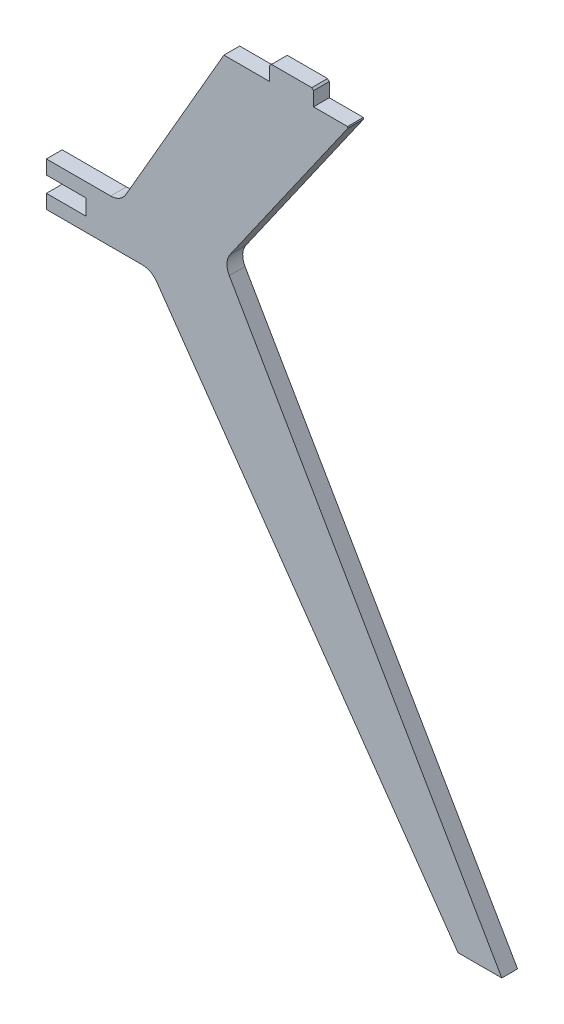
ISO-10303-21;
HEADER;
FILE_DESCRIPTION(('STEP AP214'),'2;1');
FILE_NAME('part.step','',(''),(''),'','','');
FILE_SCHEMA(('AUTOMOTIVE_DESIGN { 1 0 10303 214 1 1 1 1 }'));
ENDSEC;
DATA;
#1=APPLICATION_CONTEXT('core data for automotive mechanical design processes');
#2=APPLICATION_PROTOCOL_DEFINITION('international standard','automotive_design',2000,#1);
#3=PRODUCT_CONTEXT('',#1,'mechanical');
#4=PRODUCT('Part','Part','',(#3));
#5=PRODUCT_RELATED_PRODUCT_CATEGORY('part','',(#4));
#6=PRODUCT_DEFINITION_FORMATION('','',#4);
#7=PRODUCT_DEFINITION_CONTEXT('part definition',#1,'design');
#8=PRODUCT_DEFINITION('design','',#6,#7);
#9=PRODUCT_DEFINITION_SHAPE('','',#8);
#10=(LENGTH_UNIT() NAMED_UNIT(*) SI_UNIT(.MILLI.,.METRE.));
#11=(NAMED_UNIT(*) PLANE_ANGLE_UNIT() SI_UNIT($,.RADIAN.));
#12=(NAMED_UNIT(*) SI_UNIT($,.STERADIAN.) SOLID_ANGLE_UNIT());
#13=UNCERTAINTY_MEASURE_WITH_UNIT(LENGTH_MEASURE(1.E-05),#10,'distance_accuracy_value','');
#14=(GEOMETRIC_REPRESENTATION_CONTEXT(3) GLOBAL_UNCERTAINTY_ASSIGNED_CONTEXT((#13)) GLOBAL_UNIT_ASSIGNED_CONTEXT((#10,
#11,#12)) REPRESENTATION_CONTEXT('',''));
#15=CARTESIAN_POINT('',(0.,0.,0.));
#16=DIRECTION('',(0.,0.,1.));
#17=DIRECTION('',(1.,0.,0.));
#18=AXIS2_PLACEMENT_3D('',#15,#16,#17);
#19=CARTESIAN_POINT('',(-317.334691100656,754.,18.));
#20=DIRECTION('',(0.,-1.,0.));
#21=DIRECTION('',(0.,0.,-1.));
#22=AXIS2_PLACEMENT_3D('',#19,#20,#21);
#23=PLANE('',#22);
#24=DIRECTION('',(0.,0.,1.));
#25=VECTOR('',#24,1.);
#26=CARTESIAN_POINT('',(-264.999999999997,754.,0.));
#27=LINE('',#26,#25);
#28=CARTESIAN_POINT('',(-264.999999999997,754.,0.));
#29=VERTEX_POINT('',#28);
#30=CARTESIAN_POINT('',(-264.999999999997,754.,18.));
#31=VERTEX_POINT('',#30);
#32=EDGE_CURVE('E217',#29,#31,#27,.T.);
#33=ORIENTED_EDGE('',*,*,#32,.F.);
#34=DIRECTION('',(-1.,0.,0.));
#35=VECTOR('',#34,1.);
#36=CARTESIAN_POINT('',(-317.334691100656,754.,0.));
#37=LINE('',#36,#35);
#38=CARTESIAN_POINT('',(-317.334691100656,754.,0.));
#39=VERTEX_POINT('',#38);
#40=EDGE_CURVE('E211',#29,#39,#37,.T.);
#41=ORIENTED_EDGE('',*,*,#40,.T.);
#42=DIRECTION('',(0.,0.,-1.));
#43=VECTOR('',#42,1.);
#44=CARTESIAN_POINT('',(-317.334691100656,754.,18.));
#45=LINE('',#44,#43);
#46=CARTESIAN_POINT('',(-317.334691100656,754.,18.));
#47=VERTEX_POINT('',#46);
#48=EDGE_CURVE('E307',#47,#39,#45,.T.);
#49=ORIENTED_EDGE('',*,*,#48,.F.);
#50=DIRECTION('',(-1.,0.,0.));
#51=VECTOR('',#50,1.);
#52=CARTESIAN_POINT('',(-317.334691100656,754.,18.));
#53=LINE('',#52,#51);
#54=EDGE_CURVE('E240',#31,#47,#53,.T.);
#55=ORIENTED_EDGE('',*,*,#54,.F.);
#56=EDGE_LOOP('',(#33,#41,#49,#55));
#57=FACE_BOUND('',#56,.T.);
#58=ADVANCED_FACE('F35',(#57),#23,.F.);
#59=CARTESIAN_POINT('',(-176.136340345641,754.,18.));
#60=VERTEX_POINT('',#59);
#61=CARTESIAN_POINT('',(-214.999999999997,754.,18.));
#62=VERTEX_POINT('',#61);
#63=EDGE_CURVE('E241',#60,#62,#53,.T.);
#64=ORIENTED_EDGE('',*,*,#63,.F.);
#65=DIRECTION('',(0.,0.,-1.));
#66=VECTOR('',#65,1.);
#67=CARTESIAN_POINT('',(-176.136340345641,754.,18.));
#68=LINE('',#67,#66);
#69=CARTESIAN_POINT('',(-176.136340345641,754.,0.));
#70=VERTEX_POINT('',#69);
#71=EDGE_CURVE('E209',#60,#70,#68,.T.);
#72=ORIENTED_EDGE('',*,*,#71,.T.);
#73=CARTESIAN_POINT('',(-214.999999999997,754.,0.));
#74=VERTEX_POINT('',#73);
#75=EDGE_CURVE('E193',#70,#74,#37,.T.);
#76=ORIENTED_EDGE('',*,*,#75,.T.);
#77=DIRECTION('',(0.,0.,-1.));
#78=VECTOR('',#77,1.);
#79=CARTESIAN_POINT('',(-214.999999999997,754.,18.));
#80=LINE('',#79,#78);
#81=EDGE_CURVE('E207',#62,#74,#80,.T.);
#82=ORIENTED_EDGE('',*,*,#81,.F.);
#83=EDGE_LOOP('',(#64,#72,#76,#82));
#84=FACE_BOUND('',#83,.T.);
#85=ADVANCED_FACE('F206',(#84),#23,.F.);
#86=CARTESIAN_POINT('',(-50.,0.,18.));
#87=DIRECTION('',(0.,1.,0.));
#88=DIRECTION('',(0.,0.,1.));
#89=AXIS2_PLACEMENT_3D('',#86,#87,#88);
#90=PLANE('',#89);
#91=DIRECTION('',(1.,0.,0.));
#92=VECTOR('',#91,1.);
#93=CARTESIAN_POINT('',(-50.,0.,0.));
#94=LINE('',#93,#92);
#95=CARTESIAN_POINT('',(-50.,0.,0.));
#96=VERTEX_POINT('',#95);
#97=CARTESIAN_POINT('',(0.,0.,0.));
#98=VERTEX_POINT('',#97);
#99=EDGE_CURVE('E230',#96,#98,#94,.T.);
#100=ORIENTED_EDGE('',*,*,#99,.T.);
#101=DIRECTION('',(0.,0.,-1.));
#102=VECTOR('',#101,1.);
#103=CARTESIAN_POINT('',(0.,0.,18.));
#104=LINE('',#103,#102);
#105=CARTESIAN_POINT('',(0.,0.,18.));
#106=VERTEX_POINT('',#105);
#107=EDGE_CURVE('E310',#106,#98,#104,.T.);
#108=ORIENTED_EDGE('',*,*,#107,.F.);
#109=DIRECTION('',(1.,0.,0.));
#110=VECTOR('',#109,1.);
#111=CARTESIAN_POINT('',(-50.,0.,18.));
#112=LINE('',#111,#110);
#113=CARTESIAN_POINT('',(-50.,0.,18.));
#114=VERTEX_POINT('',#113);
#115=EDGE_CURVE('E231',#114,#106,#112,.T.);
#116=ORIENTED_EDGE('',*,*,#115,.F.);
#117=DIRECTION('',(0.,0.,-1.));
#118=VECTOR('',#117,1.);
#119=CARTESIAN_POINT('',(-50.,0.,18.));
#120=LINE('',#119,#118);
#121=EDGE_CURVE('E262',#114,#96,#120,.T.);
#122=ORIENTED_EDGE('',*,*,#121,.T.);
#123=EDGE_LOOP('',(#100,#108,#116,#122));
#124=FACE_BOUND('',#123,.T.);
#125=ADVANCED_FACE('F449',(#124),#90,.F.);
#126=CARTESIAN_POINT('',(0.,0.,18.));
#127=DIRECTION('',(-0.866025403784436,-0.500000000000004,0.));
#128=DIRECTION('',(0.500000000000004,-0.866025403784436,0.));
#129=AXIS2_PLACEMENT_3D('',#126,#127,#128);
#130=PLANE('',#129);
#131=DIRECTION('',(-0.500000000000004,0.866025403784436,0.));
#132=VECTOR('',#131,1.);
#133=CARTESIAN_POINT('',(0.,0.,0.));
#134=LINE('',#133,#132);
#135=CARTESIAN_POINT('',(-311.171945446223,538.965619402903,0.));
#136=VERTEX_POINT('',#135);
#137=EDGE_CURVE('E265',#98,#136,#134,.T.);
#138=ORIENTED_EDGE('',*,*,#137,.T.);
#139=DIRECTION('',(0.,0.,-1.));
#140=VECTOR('',#139,1.);
#141=CARTESIAN_POINT('',(-311.171945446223,538.965619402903,18.));
#142=LINE('',#141,#140);
#143=CARTESIAN_POINT('',(-311.171945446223,538.965619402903,18.));
#144=VERTEX_POINT('',#143);
#145=EDGE_CURVE('E341',#136,#144,#142,.F.);
#146=ORIENTED_EDGE('',*,*,#145,.T.);
#147=DIRECTION('',(-0.500000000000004,0.866025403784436,0.));
#148=VECTOR('',#147,1.);
#149=CARTESIAN_POINT('',(0.,0.,18.));
#150=LINE('',#149,#148);
#151=EDGE_CURVE('E234',#106,#144,#150,.T.);
#152=ORIENTED_EDGE('',*,*,#151,.F.);
#153=ORIENTED_EDGE('',*,*,#107,.T.);
#154=EDGE_LOOP('',(#138,#146,#152,#153));
#155=FACE_BOUND('',#154,.T.);
#156=ADVANCED_FACE('F446',(#155),#130,.F.);
#157=CARTESIAN_POINT('',(-317.542648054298,550.,18.));
#158=DIRECTION('',(-0.819152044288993,0.573576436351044,0.));
#159=DIRECTION('',(-0.573576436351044,-0.819152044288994,0.));
#160=AXIS2_PLACEMENT_3D('',#157,#158,#159);
#161=PLANE('',#160);
#162=DIRECTION('',(0.573576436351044,0.819152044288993,0.));
#163=VECTOR('',#162,1.);
#164=CARTESIAN_POINT('',(-317.542648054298,550.,18.));
#165=LINE('',#164,#163);
#166=CARTESIAN_POINT('',(-310.234478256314,560.437148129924,18.));
#167=VERTEX_POINT('',#166);
#168=CARTESIAN_POINT('',(-175.84746313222,752.361695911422,18.));
#169=VERTEX_POINT('',#168);
#170=EDGE_CURVE('E238',#167,#169,#165,.T.);
#171=ORIENTED_EDGE('',*,*,#170,.F.);
#172=DIRECTION('',(0.,0.,-1.));
#173=VECTOR('',#172,1.);
#174=CARTESIAN_POINT('',(-310.234478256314,560.437148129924,0.));
#175=LINE('',#174,#173);
#176=CARTESIAN_POINT('',(-310.234478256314,560.437148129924,0.));
#177=VERTEX_POINT('',#176);
#178=EDGE_CURVE('E338',#167,#177,#175,.T.);
#179=ORIENTED_EDGE('',*,*,#178,.T.);
#180=DIRECTION('',(0.573576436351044,0.819152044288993,0.));
#181=VECTOR('',#180,1.);
#182=CARTESIAN_POINT('',(-317.542648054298,550.,0.));
#183=LINE('',#182,#181);
#184=CARTESIAN_POINT('',(-175.84746313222,752.361695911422,0.));
#185=VERTEX_POINT('',#184);
#186=EDGE_CURVE('E268',#177,#185,#183,.T.);
#187=ORIENTED_EDGE('',*,*,#186,.T.);
#188=DIRECTION('',(0.,0.,1.));
#189=VECTOR('',#188,1.);
#190=CARTESIAN_POINT('',(-175.84746313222,752.361695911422,18.));
#191=LINE('',#190,#189);
#192=EDGE_CURVE('E319',#185,#169,#191,.T.);
#193=ORIENTED_EDGE('',*,*,#192,.T.);
#194=EDGE_LOOP('',(#171,#179,#187,#193));
#195=FACE_BOUND('',#194,.T.);
#196=ADVANCED_FACE('F439',(#195),#161,.F.);
#197=CARTESIAN_POINT('',(-435.114146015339,550.,18.));
#198=DIRECTION('',(0.86602540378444,-0.499999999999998,0.));
#199=DIRECTION('',(0.499999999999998,0.86602540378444,0.));
#200=AXIS2_PLACEMENT_3D('',#197,#198,#199);
#201=PLANE('',#200);
#202=DIRECTION('',(-0.499999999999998,-0.86602540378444,0.));
#203=VECTOR('',#202,1.);
#204=CARTESIAN_POINT('',(-435.114146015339,550.,0.));
#205=LINE('',#204,#203);
#206=CARTESIAN_POINT('',(-429.340643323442,560.,0.));
#207=VERTEX_POINT('',#206);
#208=EDGE_CURVE('E210',#39,#207,#205,.T.);
#209=ORIENTED_EDGE('',*,*,#208,.T.);
#210=DIRECTION('',(0.,0.,-1.));
#211=VECTOR('',#210,1.);
#212=CARTESIAN_POINT('',(-429.340643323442,560.,18.));
#213=LINE('',#212,#211);
#214=CARTESIAN_POINT('',(-429.340643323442,560.,18.));
#215=VERTEX_POINT('',#214);
#216=EDGE_CURVE('E50',#207,#215,#213,.F.);
#217=ORIENTED_EDGE('',*,*,#216,.T.);
#218=DIRECTION('',(-0.499999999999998,-0.86602540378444,0.));
#219=VECTOR('',#218,1.);
#220=CARTESIAN_POINT('',(-435.114146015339,550.,18.));
#221=LINE('',#220,#219);
#222=EDGE_CURVE('E243',#47,#215,#221,.T.);
#223=ORIENTED_EDGE('',*,*,#222,.F.);
#224=ORIENTED_EDGE('',*,*,#48,.T.);
#225=EDGE_LOOP('',(#209,#217,#223,#224));
#226=FACE_BOUND('',#225,.T.);
#227=ADVANCED_FACE('F411',(#226),#201,.F.);
#228=CARTESIAN_POINT('',(-520.,550.,18.));
#229=DIRECTION('',(0.,-1.,0.));
#230=DIRECTION('',(0.,0.,-1.));
#231=AXIS2_PLACEMENT_3D('',#228,#229,#230);
#232=PLANE('',#231);
#233=DIRECTION('',(-1.,0.,0.));
#234=VECTOR('',#233,1.);
#235=CARTESIAN_POINT('',(-520.,550.,18.));
#236=LINE('',#235,#234);
#237=CARTESIAN_POINT('',(-446.661151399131,550.,18.));
#238=VERTEX_POINT('',#237);
#239=CARTESIAN_POINT('',(-520.,550.,18.));
#240=VERTEX_POINT('',#239);
#241=EDGE_CURVE('E245',#238,#240,#236,.T.);
#242=ORIENTED_EDGE('',*,*,#241,.F.);
#243=DIRECTION('',(0.,0.,-1.));
#244=VECTOR('',#243,1.);
#245=CARTESIAN_POINT('',(-446.661151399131,550.,0.));
#246=LINE('',#245,#244);
#247=CARTESIAN_POINT('',(-446.661151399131,550.,0.));
#248=VERTEX_POINT('',#247);
#249=EDGE_CURVE('E348',#238,#248,#246,.T.);
#250=ORIENTED_EDGE('',*,*,#249,.T.);
#251=DIRECTION('',(-1.,0.,0.));
#252=VECTOR('',#251,1.);
#253=CARTESIAN_POINT('',(-520.,550.,0.));
#254=LINE('',#253,#252);
#255=CARTESIAN_POINT('',(-520.,550.,0.));
#256=VERTEX_POINT('',#255);
#257=EDGE_CURVE('E271',#248,#256,#254,.T.);
#258=ORIENTED_EDGE('',*,*,#257,.T.);
#259=DIRECTION('',(0.,0.,-1.));
#260=VECTOR('',#259,1.);
#261=CARTESIAN_POINT('',(-520.,550.,18.));
#262=LINE('',#261,#260);
#263=EDGE_CURVE('E304',#240,#256,#262,.T.);
#264=ORIENTED_EDGE('',*,*,#263,.F.);
#265=EDGE_LOOP('',(#242,#250,#258,#264));
#266=FACE_BOUND('',#265,.T.);
#267=ADVANCED_FACE('F405',(#266),#232,.F.);
#268=CARTESIAN_POINT('',(-520.,550.,18.));
#269=DIRECTION('',(1.,0.,0.));
#270=DIRECTION('',(0.,1.,0.));
#271=AXIS2_PLACEMENT_3D('',#268,#269,#270);
#272=PLANE('',#271);
#273=DIRECTION('',(0.,-1.,0.));
#274=VECTOR('',#273,1.);
#275=CARTESIAN_POINT('',(-520.,550.,0.));
#276=LINE('',#275,#274);
#277=CARTESIAN_POINT('',(-520.,534.,0.));
#278=VERTEX_POINT('',#277);
#279=EDGE_CURVE('E273',#256,#278,#276,.T.);
#280=ORIENTED_EDGE('',*,*,#279,.T.);
#281=DIRECTION('',(0.,0.,-1.));
#282=VECTOR('',#281,1.);
#283=CARTESIAN_POINT('',(-520.,534.,18.));
#284=LINE('',#283,#282);
#285=CARTESIAN_POINT('',(-520.,534.,18.));
#286=VERTEX_POINT('',#285);
#287=EDGE_CURVE('E301',#286,#278,#284,.T.);
#288=ORIENTED_EDGE('',*,*,#287,.F.);
#289=DIRECTION('',(0.,-1.,0.));
#290=VECTOR('',#289,1.);
#291=CARTESIAN_POINT('',(-520.,550.,18.));
#292=LINE('',#291,#290);
#293=EDGE_CURVE('E247',#240,#286,#292,.T.);
#294=ORIENTED_EDGE('',*,*,#293,.F.);
#295=ORIENTED_EDGE('',*,*,#263,.T.);
#296=EDGE_LOOP('',(#280,#288,#294,#295));
#297=FACE_BOUND('',#296,.T.);
#298=ADVANCED_FACE('F400',(#297),#272,.F.);
#299=CARTESIAN_POINT('',(-520.,534.,18.));
#300=DIRECTION('',(0.,1.,0.));
#301=DIRECTION('',(-1.,0.,0.));
#302=AXIS2_PLACEMENT_3D('',#299,#300,#301);
#303=PLANE('',#302);
#304=DIRECTION('',(1.,0.,0.));
#305=VECTOR('',#304,1.);
#306=CARTESIAN_POINT('',(-520.,534.,0.));
#307=LINE('',#306,#305);
#308=CARTESIAN_POINT('',(-475.,534.,0.));
#309=VERTEX_POINT('',#308);
#310=EDGE_CURVE('E275',#278,#309,#307,.T.);
#311=ORIENTED_EDGE('',*,*,#310,.T.);
#312=DIRECTION('',(0.,0.,-1.));
#313=VECTOR('',#312,1.);
#314=CARTESIAN_POINT('',(-475.,534.,18.));
#315=LINE('',#314,#313);
#316=CARTESIAN_POINT('',(-475.,534.,18.));
#317=VERTEX_POINT('',#316);
#318=EDGE_CURVE('E298',#317,#309,#315,.T.);
#319=ORIENTED_EDGE('',*,*,#318,.F.);
#320=DIRECTION('',(1.,0.,0.));
#321=VECTOR('',#320,1.);
#322=CARTESIAN_POINT('',(-520.,534.,18.));
#323=LINE('',#322,#321);
#324=EDGE_CURVE('E249',#286,#317,#323,.T.);
#325=ORIENTED_EDGE('',*,*,#324,.F.);
#326=ORIENTED_EDGE('',*,*,#287,.T.);
#327=EDGE_LOOP('',(#311,#319,#325,#326));
#328=FACE_BOUND('',#327,.T.);
#329=ADVANCED_FACE('F396',(#328),#303,.F.);
#330=CARTESIAN_POINT('',(-475.,534.,18.));
#331=DIRECTION('',(1.,0.,0.));
#332=DIRECTION('',(0.,1.,0.));
#333=AXIS2_PLACEMENT_3D('',#330,#331,#332);
#334=PLANE('',#333);
#335=DIRECTION('',(0.,-1.,0.));
#336=VECTOR('',#335,1.);
#337=CARTESIAN_POINT('',(-475.,534.,0.));
#338=LINE('',#337,#336);
#339=CARTESIAN_POINT('',(-475.,516.,0.));
#340=VERTEX_POINT('',#339);
#341=EDGE_CURVE('E277',#309,#340,#338,.T.);
#342=ORIENTED_EDGE('',*,*,#341,.T.);
#343=DIRECTION('',(0.,0.,-1.));
#344=VECTOR('',#343,1.);
#345=CARTESIAN_POINT('',(-475.,516.,18.));
#346=LINE('',#345,#344);
#347=CARTESIAN_POINT('',(-475.,516.,18.));
#348=VERTEX_POINT('',#347);
#349=EDGE_CURVE('E295',#348,#340,#346,.T.);
#350=ORIENTED_EDGE('',*,*,#349,.F.);
#351=DIRECTION('',(0.,-1.,0.));
#352=VECTOR('',#351,1.);
#353=CARTESIAN_POINT('',(-475.,534.,18.));
#354=LINE('',#353,#352);
#355=EDGE_CURVE('E251',#317,#348,#354,.T.);
#356=ORIENTED_EDGE('',*,*,#355,.F.);
#357=ORIENTED_EDGE('',*,*,#318,.T.);
#358=EDGE_LOOP('',(#342,#350,#356,#357));
#359=FACE_BOUND('',#358,.T.);
#360=ADVANCED_FACE('F392',(#359),#334,.F.);
#361=CARTESIAN_POINT('',(-475.,516.,18.));
#362=DIRECTION('',(0.,-1.,0.));
#363=DIRECTION('',(0.,0.,-1.));
#364=AXIS2_PLACEMENT_3D('',#361,#362,#363);
#365=PLANE('',#364);
#366=DIRECTION('',(-1.,0.,0.));
#367=VECTOR('',#366,1.);
#368=CARTESIAN_POINT('',(-475.,516.,0.));
#369=LINE('',#368,#367);
#370=CARTESIAN_POINT('',(-520.,516.,0.));
#371=VERTEX_POINT('',#370);
#372=EDGE_CURVE('E279',#340,#371,#369,.T.);
#373=ORIENTED_EDGE('',*,*,#372,.T.);
#374=DIRECTION('',(0.,0.,-1.));
#375=VECTOR('',#374,1.);
#376=CARTESIAN_POINT('',(-520.,516.,18.));
#377=LINE('',#376,#375);
#378=CARTESIAN_POINT('',(-520.,516.,18.));
#379=VERTEX_POINT('',#378);
#380=EDGE_CURVE('E292',#379,#371,#377,.T.);
#381=ORIENTED_EDGE('',*,*,#380,.F.);
#382=DIRECTION('',(-1.,0.,0.));
#383=VECTOR('',#382,1.);
#384=CARTESIAN_POINT('',(-475.,516.,18.));
#385=LINE('',#384,#383);
#386=EDGE_CURVE('E253',#348,#379,#385,.T.);
#387=ORIENTED_EDGE('',*,*,#386,.F.);
#388=ORIENTED_EDGE('',*,*,#349,.T.);
#389=EDGE_LOOP('',(#373,#381,#387,#388));
#390=FACE_BOUND('',#389,.T.);
#391=ADVANCED_FACE('F387',(#390),#365,.F.);
#392=CARTESIAN_POINT('',(-520.,516.,18.));
#393=DIRECTION('',(1.,0.,0.));
#394=DIRECTION('',(0.,1.,0.));
#395=AXIS2_PLACEMENT_3D('',#392,#393,#394);
#396=PLANE('',#395);
#397=DIRECTION('',(0.,-1.,0.));
#398=VECTOR('',#397,1.);
#399=CARTESIAN_POINT('',(-520.,516.,0.));
#400=LINE('',#399,#398);
#401=CARTESIAN_POINT('',(-520.,500.,0.));
#402=VERTEX_POINT('',#401);
#403=EDGE_CURVE('E281',#371,#402,#400,.T.);
#404=ORIENTED_EDGE('',*,*,#403,.T.);
#405=DIRECTION('',(0.,0.,-1.));
#406=VECTOR('',#405,1.);
#407=CARTESIAN_POINT('',(-520.,500.,18.));
#408=LINE('',#407,#406);
#409=CARTESIAN_POINT('',(-520.,500.,18.));
#410=VERTEX_POINT('',#409);
#411=EDGE_CURVE('E289',#410,#402,#408,.T.);
#412=ORIENTED_EDGE('',*,*,#411,.F.);
#413=DIRECTION('',(0.,-1.,0.));
#414=VECTOR('',#413,1.);
#415=CARTESIAN_POINT('',(-520.,516.,18.));
#416=LINE('',#415,#414);
#417=EDGE_CURVE('E255',#379,#410,#416,.T.);
#418=ORIENTED_EDGE('',*,*,#417,.F.);
#419=ORIENTED_EDGE('',*,*,#380,.T.);
#420=EDGE_LOOP('',(#404,#412,#418,#419));
#421=FACE_BOUND('',#420,.T.);
#422=ADVANCED_FACE('F381',(#421),#396,.F.);
#423=CARTESIAN_POINT('',(-400.103769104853,500.,18.));
#424=DIRECTION('',(0.,1.,0.));
#425=DIRECTION('',(0.,0.,1.));
#426=AXIS2_PLACEMENT_3D('',#423,#424,#425);
#427=PLANE('',#426);
#428=DIRECTION('',(1.,0.,0.));
#429=VECTOR('',#428,1.);
#430=CARTESIAN_POINT('',(-400.103769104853,500.,0.));
#431=LINE('',#430,#429);
#432=CARTESIAN_POINT('',(-410.515110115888,500.,0.));
#433=VERTEX_POINT('',#432);
#434=EDGE_CURVE('E283',#402,#433,#431,.T.);
#435=ORIENTED_EDGE('',*,*,#434,.T.);
#436=DIRECTION('',(0.,0.,-1.));
#437=VECTOR('',#436,1.);
#438=CARTESIAN_POINT('',(-410.515110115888,500.,18.));
#439=LINE('',#438,#437);
#440=CARTESIAN_POINT('',(-410.515110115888,500.,18.));
#441=VERTEX_POINT('',#440);
#442=EDGE_CURVE('E346',#433,#441,#439,.F.);
#443=ORIENTED_EDGE('',*,*,#442,.T.);
#444=DIRECTION('',(1.,0.,0.));
#445=VECTOR('',#444,1.);
#446=CARTESIAN_POINT('',(-400.103769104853,500.,18.));
#447=LINE('',#446,#445);
#448=EDGE_CURVE('E257',#410,#441,#447,.T.);
#449=ORIENTED_EDGE('',*,*,#448,.F.);
#450=ORIENTED_EDGE('',*,*,#411,.T.);
#451=EDGE_LOOP('',(#435,#443,#449,#450));
#452=FACE_BOUND('',#451,.T.);
#453=ADVANCED_FACE('F377',(#452),#427,.F.);
#454=CARTESIAN_POINT('',(-400.103769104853,500.,18.));
#455=DIRECTION('',(0.819152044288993,0.573576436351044,0.));
#456=DIRECTION('',(-0.573576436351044,0.819152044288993,0.));
#457=AXIS2_PLACEMENT_3D('',#454,#455,#456);
#458=PLANE('',#457);
#459=DIRECTION('',(0.573576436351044,-0.819152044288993,0.));
#460=VECTOR('',#459,1.);
#461=CARTESIAN_POINT('',(-400.103769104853,500.,18.));
#462=LINE('',#461,#460);
#463=CARTESIAN_POINT('',(-394.132069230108,491.471528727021,18.));
#464=VERTEX_POINT('',#463);
#465=EDGE_CURVE('E260',#464,#114,#462,.T.);
#466=ORIENTED_EDGE('',*,*,#465,.F.);
#467=DIRECTION('',(0.,0.,-1.));
#468=VECTOR('',#467,1.);
#469=CARTESIAN_POINT('',(-394.132069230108,491.471528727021,0.));
#470=LINE('',#469,#468);
#471=CARTESIAN_POINT('',(-394.132069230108,491.471528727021,0.));
#472=VERTEX_POINT('',#471);
#473=EDGE_CURVE('E343',#464,#472,#470,.T.);
#474=ORIENTED_EDGE('',*,*,#473,.T.);
#475=DIRECTION('',(0.573576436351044,-0.819152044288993,0.));
#476=VECTOR('',#475,1.);
#477=CARTESIAN_POINT('',(-400.103769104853,500.,0.));
#478=LINE('',#477,#476);
#479=EDGE_CURVE('E235',#472,#96,#478,.T.);
#480=ORIENTED_EDGE('',*,*,#479,.T.);
#481=ORIENTED_EDGE('',*,*,#121,.F.);
#482=EDGE_LOOP('',(#466,#474,#480,#481));
#483=FACE_BOUND('',#482,.T.);
#484=ADVANCED_FACE('F369',(#483),#458,.F.);
#485=CARTESIAN_POINT('',(0.,0.,18.));
#486=DIRECTION('',(0.,0.,-1.));
#487=DIRECTION('',(-1.,0.,0.));
#488=AXIS2_PLACEMENT_3D('',#485,#486,#487);
#489=PLANE('',#488);
#490=ORIENTED_EDGE('',*,*,#151,.T.);
#491=CARTESIAN_POINT('',(-293.851437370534,548.965619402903,18.));
#492=DIRECTION('',(0.,0.,-1.));
#493=DIRECTION('',(-1.,0.,0.));
#494=AXIS2_PLACEMENT_3D('',#491,#492,#493);
#495=CIRCLE('',#494,20.);
#496=EDGE_CURVE('E354',#144,#167,#495,.T.);
#497=ORIENTED_EDGE('',*,*,#496,.T.);
#498=ORIENTED_EDGE('',*,*,#170,.T.);
#499=DIRECTION('',(0.17364817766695,-0.984807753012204,0.));
#500=VECTOR('',#499,1.);
#501=CARTESIAN_POINT('',(-176.136340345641,754.,18.));
#502=LINE('',#501,#500);
#503=EDGE_CURVE('E326',#169,#60,#502,.F.);
#504=ORIENTED_EDGE('',*,*,#503,.T.);
#505=ORIENTED_EDGE('',*,*,#63,.T.);
#506=DIRECTION('',(0.,-1.,0.));
#507=VECTOR('',#506,1.);
#508=CARTESIAN_POINT('',(-214.999999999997,772.,18.));
#509=LINE('',#508,#507);
#510=CARTESIAN_POINT('',(-214.999999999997,770.,18.));
#511=VERTEX_POINT('',#510);
#512=EDGE_CURVE('E199',#511,#62,#509,.T.);
#513=ORIENTED_EDGE('',*,*,#512,.F.);
#514=DIRECTION('',(-0.707106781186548,0.707106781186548,0.));
#515=VECTOR('',#514,1.);
#516=CARTESIAN_POINT('',(-216.999999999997,772.,18.));
#517=LINE('',#516,#515);
#518=CARTESIAN_POINT('',(-216.999999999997,772.,18.));
#519=VERTEX_POINT('',#518);
#520=EDGE_CURVE('E322',#511,#519,#517,.T.);
#521=ORIENTED_EDGE('',*,*,#520,.T.);
#522=DIRECTION('',(1.,0.,0.));
#523=VECTOR('',#522,1.);
#524=CARTESIAN_POINT('',(-264.999999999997,772.,18.));
#525=LINE('',#524,#523);
#526=CARTESIAN_POINT('',(-262.999999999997,772.,18.));
#527=VERTEX_POINT('',#526);
#528=EDGE_CURVE('E216',#527,#519,#525,.T.);
#529=ORIENTED_EDGE('',*,*,#528,.F.);
#530=DIRECTION('',(-0.707106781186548,-0.707106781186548,0.));
#531=VECTOR('',#530,1.);
#532=CARTESIAN_POINT('',(-262.999999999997,772.,18.));
#533=LINE('',#532,#531);
#534=CARTESIAN_POINT('',(-264.999999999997,770.,18.));
#535=VERTEX_POINT('',#534);
#536=EDGE_CURVE('E324',#527,#535,#533,.T.);
#537=ORIENTED_EDGE('',*,*,#536,.T.);
#538=DIRECTION('',(0.,-1.,0.));
#539=VECTOR('',#538,1.);
#540=CARTESIAN_POINT('',(-264.999999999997,772.,18.));
#541=LINE('',#540,#539);
#542=EDGE_CURVE('E228',#535,#31,#541,.T.);
#543=ORIENTED_EDGE('',*,*,#542,.T.);
#544=ORIENTED_EDGE('',*,*,#54,.T.);
#545=ORIENTED_EDGE('',*,*,#222,.T.);
#546=CARTESIAN_POINT('',(-446.661151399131,570.,18.));
#547=DIRECTION('',(0.,0.,-1.));
#548=DIRECTION('',(-1.,0.,0.));
#549=AXIS2_PLACEMENT_3D('',#546,#547,#548);
#550=CIRCLE('',#549,20.);
#551=EDGE_CURVE('E11',#215,#238,#550,.T.);
#552=ORIENTED_EDGE('',*,*,#551,.T.);
#553=ORIENTED_EDGE('',*,*,#241,.T.);
#554=ORIENTED_EDGE('',*,*,#293,.T.);
#555=ORIENTED_EDGE('',*,*,#324,.T.);
#556=ORIENTED_EDGE('',*,*,#355,.T.);
#557=ORIENTED_EDGE('',*,*,#386,.T.);
#558=ORIENTED_EDGE('',*,*,#417,.T.);
#559=ORIENTED_EDGE('',*,*,#448,.T.);
#560=CARTESIAN_POINT('',(-410.515110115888,480.,18.));
#561=DIRECTION('',(0.,0.,-1.));
#562=DIRECTION('',(-1.,0.,0.));
#563=AXIS2_PLACEMENT_3D('',#560,#561,#562);
#564=CIRCLE('',#563,20.);
#565=EDGE_CURVE('E358',#441,#464,#564,.T.);
#566=ORIENTED_EDGE('',*,*,#565,.T.);
#567=ORIENTED_EDGE('',*,*,#465,.T.);
#568=ORIENTED_EDGE('',*,*,#115,.T.);
#569=EDGE_LOOP('',(#490,#497,#498,#504,#505,#513,#521,#529,#537,#543,#544,#545,#552,#553,#554,
#555,#556,#557,#558,#559,#566,#567,#568));
#570=FACE_BOUND('',#569,.T.);
#571=ADVANCED_FACE('F362',(#570),#489,.F.);
#572=CARTESIAN_POINT('',(0.,0.,0.));
#573=DIRECTION('',(0.,0.,-1.));
#574=DIRECTION('',(-1.,0.,0.));
#575=AXIS2_PLACEMENT_3D('',#572,#573,#574);
#576=PLANE('',#575);
#577=ORIENTED_EDGE('',*,*,#75,.F.);
#578=DIRECTION('',(-0.17364817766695,0.984807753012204,0.));
#579=VECTOR('',#578,1.);
#580=CARTESIAN_POINT('',(-41.8835857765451,-7.38520622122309,0.));
#581=LINE('',#580,#579);
#582=EDGE_CURVE('E317',#70,#185,#581,.F.);
#583=ORIENTED_EDGE('',*,*,#582,.T.);
#584=ORIENTED_EDGE('',*,*,#186,.F.);
#585=CARTESIAN_POINT('',(-293.851437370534,548.965619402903,0.));
#586=DIRECTION('',(0.,0.,-1.));
#587=DIRECTION('',(-1.,0.,0.));
#588=AXIS2_PLACEMENT_3D('',#585,#586,#587);
#589=CIRCLE('',#588,20.);
#590=EDGE_CURVE('E352',#177,#136,#589,.F.);
#591=ORIENTED_EDGE('',*,*,#590,.T.);
#592=ORIENTED_EDGE('',*,*,#137,.F.);
#593=ORIENTED_EDGE('',*,*,#99,.F.);
#594=ORIENTED_EDGE('',*,*,#479,.F.);
#595=CARTESIAN_POINT('',(-410.515110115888,480.,0.));
#596=DIRECTION('',(0.,0.,-1.));
#597=DIRECTION('',(-1.,0.,0.));
#598=AXIS2_PLACEMENT_3D('',#595,#596,#597);
#599=CIRCLE('',#598,20.);
#600=EDGE_CURVE('E356',#472,#433,#599,.F.);
#601=ORIENTED_EDGE('',*,*,#600,.T.);
#602=ORIENTED_EDGE('',*,*,#434,.F.);
#603=ORIENTED_EDGE('',*,*,#403,.F.);
#604=ORIENTED_EDGE('',*,*,#372,.F.);
#605=ORIENTED_EDGE('',*,*,#341,.F.);
#606=ORIENTED_EDGE('',*,*,#310,.F.);
#607=ORIENTED_EDGE('',*,*,#279,.F.);
#608=ORIENTED_EDGE('',*,*,#257,.F.);
#609=CARTESIAN_POINT('',(-446.661151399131,570.,0.));
#610=DIRECTION('',(0.,0.,-1.));
#611=DIRECTION('',(-1.,0.,0.));
#612=AXIS2_PLACEMENT_3D('',#609,#610,#611);
#613=CIRCLE('',#612,20.);
#614=EDGE_CURVE('E43',#248,#207,#613,.F.);
#615=ORIENTED_EDGE('',*,*,#614,.T.);
#616=ORIENTED_EDGE('',*,*,#208,.F.);
#617=ORIENTED_EDGE('',*,*,#40,.F.);
#618=DIRECTION('',(0.,-1.,0.));
#619=VECTOR('',#618,1.);
#620=CARTESIAN_POINT('',(-264.999999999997,772.,0.));
#621=LINE('',#620,#619);
#622=CARTESIAN_POINT('',(-264.999999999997,770.,0.));
#623=VERTEX_POINT('',#622);
#624=EDGE_CURVE('E200',#623,#29,#621,.T.);
#625=ORIENTED_EDGE('',*,*,#624,.F.);
#626=DIRECTION('',(0.707106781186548,0.707106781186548,0.));
#627=VECTOR('',#626,1.);
#628=CARTESIAN_POINT('',(-517.499999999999,517.499999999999,0.));
#629=LINE('',#628,#627);
#630=CARTESIAN_POINT('',(-262.999999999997,772.,0.));
#631=VERTEX_POINT('',#630);
#632=EDGE_CURVE('E315',#623,#631,#629,.T.);
#633=ORIENTED_EDGE('',*,*,#632,.T.);
#634=DIRECTION('',(-1.,0.,0.));
#635=VECTOR('',#634,1.);
#636=CARTESIAN_POINT('',(-214.999999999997,772.,0.));
#637=LINE('',#636,#635);
#638=CARTESIAN_POINT('',(-216.999999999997,772.,0.));
#639=VERTEX_POINT('',#638);
#640=EDGE_CURVE('E220',#639,#631,#637,.T.);
#641=ORIENTED_EDGE('',*,*,#640,.F.);
#642=DIRECTION('',(0.707106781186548,-0.707106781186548,0.));
#643=VECTOR('',#642,1.);
#644=CARTESIAN_POINT('',(277.500000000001,277.500000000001,0.));
#645=LINE('',#644,#643);
#646=CARTESIAN_POINT('',(-214.999999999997,770.,0.));
#647=VERTEX_POINT('',#646);
#648=EDGE_CURVE('E195',#639,#647,#645,.T.);
#649=ORIENTED_EDGE('',*,*,#648,.T.);
#650=DIRECTION('',(0.,-1.,0.));
#651=VECTOR('',#650,1.);
#652=CARTESIAN_POINT('',(-214.999999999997,772.,0.));
#653=LINE('',#652,#651);
#654=EDGE_CURVE('E189',#647,#74,#653,.T.);
#655=ORIENTED_EDGE('',*,*,#654,.T.);
#656=EDGE_LOOP('',(#577,#583,#584,#591,#592,#593,#594,#601,#602,#603,#604,#605,#606,#607,#608,
#615,#616,#617,#625,#633,#641,#649,#655));
#657=FACE_BOUND('',#656,.T.);
#658=ADVANCED_FACE('F191',(#657),#576,.T.);
#659=CARTESIAN_POINT('',(-264.999999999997,772.,0.));
#660=DIRECTION('',(1.,0.,0.));
#661=DIRECTION('',(0.,0.,-1.));
#662=AXIS2_PLACEMENT_3D('',#659,#660,#661);
#663=PLANE('',#662);
#664=ORIENTED_EDGE('',*,*,#542,.F.);
#665=DIRECTION('',(0.,0.,-1.));
#666=VECTOR('',#665,1.);
#667=CARTESIAN_POINT('',(-264.999999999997,770.,0.));
#668=LINE('',#667,#666);
#669=EDGE_CURVE('E334',#535,#623,#668,.T.);
#670=ORIENTED_EDGE('',*,*,#669,.T.);
#671=ORIENTED_EDGE('',*,*,#624,.T.);
#672=ORIENTED_EDGE('',*,*,#32,.T.);
#673=EDGE_LOOP('',(#664,#670,#671,#672));
#674=FACE_BOUND('',#673,.T.);
#675=ADVANCED_FACE('F419',(#674),#663,.F.);
#676=CARTESIAN_POINT('',(-214.999999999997,772.,18.));
#677=DIRECTION('',(-1.,0.,0.));
#678=DIRECTION('',(0.,0.,1.));
#679=AXIS2_PLACEMENT_3D('',#676,#677,#678);
#680=PLANE('',#679);
#681=ORIENTED_EDGE('',*,*,#654,.F.);
#682=DIRECTION('',(0.,0.,1.));
#683=VECTOR('',#682,1.);
#684=CARTESIAN_POINT('',(-214.999999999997,770.,18.));
#685=LINE('',#684,#683);
#686=EDGE_CURVE('E336',#647,#511,#685,.T.);
#687=ORIENTED_EDGE('',*,*,#686,.T.);
#688=ORIENTED_EDGE('',*,*,#512,.T.);
#689=ORIENTED_EDGE('',*,*,#81,.T.);
#690=EDGE_LOOP('',(#681,#687,#688,#689));
#691=FACE_BOUND('',#690,.T.);
#692=ADVANCED_FACE('F213',(#691),#680,.F.);
#693=CARTESIAN_POINT('',(0.,772.,0.));
#694=DIRECTION('',(0.,1.,0.));
#695=DIRECTION('',(0.,0.,1.));
#696=AXIS2_PLACEMENT_3D('',#693,#694,#695);
#697=PLANE('',#696);
#698=ORIENTED_EDGE('',*,*,#640,.T.);
#699=DIRECTION('',(0.,0.,1.));
#700=VECTOR('',#699,1.);
#701=CARTESIAN_POINT('',(-262.999999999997,772.,18.));
#702=LINE('',#701,#700);
#703=EDGE_CURVE('E331',#631,#527,#702,.T.);
#704=ORIENTED_EDGE('',*,*,#703,.T.);
#705=ORIENTED_EDGE('',*,*,#528,.T.);
#706=DIRECTION('',(0.,0.,-1.));
#707=VECTOR('',#706,1.);
#708=CARTESIAN_POINT('',(-216.999999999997,772.,0.));
#709=LINE('',#708,#707);
#710=EDGE_CURVE('E328',#519,#639,#709,.T.);
#711=ORIENTED_EDGE('',*,*,#710,.T.);
#712=EDGE_LOOP('',(#698,#704,#705,#711));
#713=FACE_BOUND('',#712,.T.);
#714=ADVANCED_FACE('F426',(#713),#697,.T.);
#715=CARTESIAN_POINT('',(-176.136340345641,754.,18.));
#716=DIRECTION('',(-0.984807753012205,-0.17364817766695,0.));
#717=DIRECTION('',(0.,0.,-1.));
#718=AXIS2_PLACEMENT_3D('',#715,#716,#717);
#719=PLANE('',#718);
#720=ORIENTED_EDGE('',*,*,#503,.F.);
#721=ORIENTED_EDGE('',*,*,#192,.F.);
#722=ORIENTED_EDGE('',*,*,#582,.F.);
#723=ORIENTED_EDGE('',*,*,#71,.F.);
#724=EDGE_LOOP('',(#720,#721,#722,#723));
#725=FACE_BOUND('',#724,.T.);
#726=ADVANCED_FACE('F434',(#725),#719,.F.);
#727=CARTESIAN_POINT('',(-262.999999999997,772.,0.));
#728=DIRECTION('',(-0.707106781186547,0.707106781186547,0.));
#729=DIRECTION('',(0.,0.,-1.));
#730=AXIS2_PLACEMENT_3D('',#727,#728,#729);
#731=PLANE('',#730);
#732=ORIENTED_EDGE('',*,*,#632,.F.);
#733=ORIENTED_EDGE('',*,*,#669,.F.);
#734=ORIENTED_EDGE('',*,*,#536,.F.);
#735=ORIENTED_EDGE('',*,*,#703,.F.);
#736=EDGE_LOOP('',(#732,#733,#734,#735));
#737=FACE_BOUND('',#736,.T.);
#738=ADVANCED_FACE('F422',(#737),#731,.T.);
#739=CARTESIAN_POINT('',(-216.999999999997,772.,0.));
#740=DIRECTION('',(0.707106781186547,0.707106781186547,0.));
#741=DIRECTION('',(0.,0.,1.));
#742=AXIS2_PLACEMENT_3D('',#739,#740,#741);
#743=PLANE('',#742);
#744=ORIENTED_EDGE('',*,*,#520,.F.);
#745=ORIENTED_EDGE('',*,*,#686,.F.);
#746=ORIENTED_EDGE('',*,*,#648,.F.);
#747=ORIENTED_EDGE('',*,*,#710,.F.);
#748=EDGE_LOOP('',(#744,#745,#746,#747));
#749=FACE_BOUND('',#748,.T.);
#750=ADVANCED_FACE('F431',(#749),#743,.T.);
#751=CARTESIAN_POINT('',(-293.851437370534,548.965619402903,18.));
#752=DIRECTION('',(0.,0.,1.));
#753=DIRECTION('',(1.,0.,0.));
#754=AXIS2_PLACEMENT_3D('',#751,#752,#753);
#755=CYLINDRICAL_SURFACE('',#754,20.);
#756=ORIENTED_EDGE('',*,*,#496,.F.);
#757=ORIENTED_EDGE('',*,*,#145,.F.);
#758=ORIENTED_EDGE('',*,*,#590,.F.);
#759=ORIENTED_EDGE('',*,*,#178,.F.);
#760=EDGE_LOOP('',(#756,#757,#758,#759));
#761=FACE_BOUND('',#760,.T.);
#762=ADVANCED_FACE('F443',(#761),#755,.F.);
#763=CARTESIAN_POINT('',(-410.515110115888,480.,18.));
#764=DIRECTION('',(0.,0.,1.));
#765=DIRECTION('',(1.,0.,0.));
#766=AXIS2_PLACEMENT_3D('',#763,#764,#765);
#767=CYLINDRICAL_SURFACE('',#766,20.);
#768=ORIENTED_EDGE('',*,*,#565,.F.);
#769=ORIENTED_EDGE('',*,*,#442,.F.);
#770=ORIENTED_EDGE('',*,*,#600,.F.);
#771=ORIENTED_EDGE('',*,*,#473,.F.);
#772=EDGE_LOOP('',(#768,#769,#770,#771));
#773=FACE_BOUND('',#772,.T.);
#774=ADVANCED_FACE('F372',(#773),#767,.F.);
#775=CARTESIAN_POINT('',(-446.661151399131,570.,18.));
#776=DIRECTION('',(0.,0.,1.));
#777=DIRECTION('',(1.,0.,0.));
#778=AXIS2_PLACEMENT_3D('',#775,#776,#777);
#779=CYLINDRICAL_SURFACE('',#778,20.);
#780=ORIENTED_EDGE('',*,*,#551,.F.);
#781=ORIENTED_EDGE('',*,*,#216,.F.);
#782=ORIENTED_EDGE('',*,*,#614,.F.);
#783=ORIENTED_EDGE('',*,*,#249,.F.);
#784=EDGE_LOOP('',(#780,#781,#782,#783));
#785=FACE_BOUND('',#784,.T.);
#786=ADVANCED_FACE('F37',(#785),#779,.F.);
#787=CLOSED_SHELL('',(#58,#85,#125,#156,#196,#227,#267,#298,#329,#360,#391,#422,#453,#484,#571,
#658,#675,#692,#714,#726,#738,#750,#762,#774,#786));
#788=MANIFOLD_SOLID_BREP('B2',#787);
#789=ADVANCED_BREP_SHAPE_REPRESENTATION('',(#18,#788),#14);
#790=SHAPE_DEFINITION_REPRESENTATION(#9,#789);
ENDSEC;
END-ISO-10303-21;
